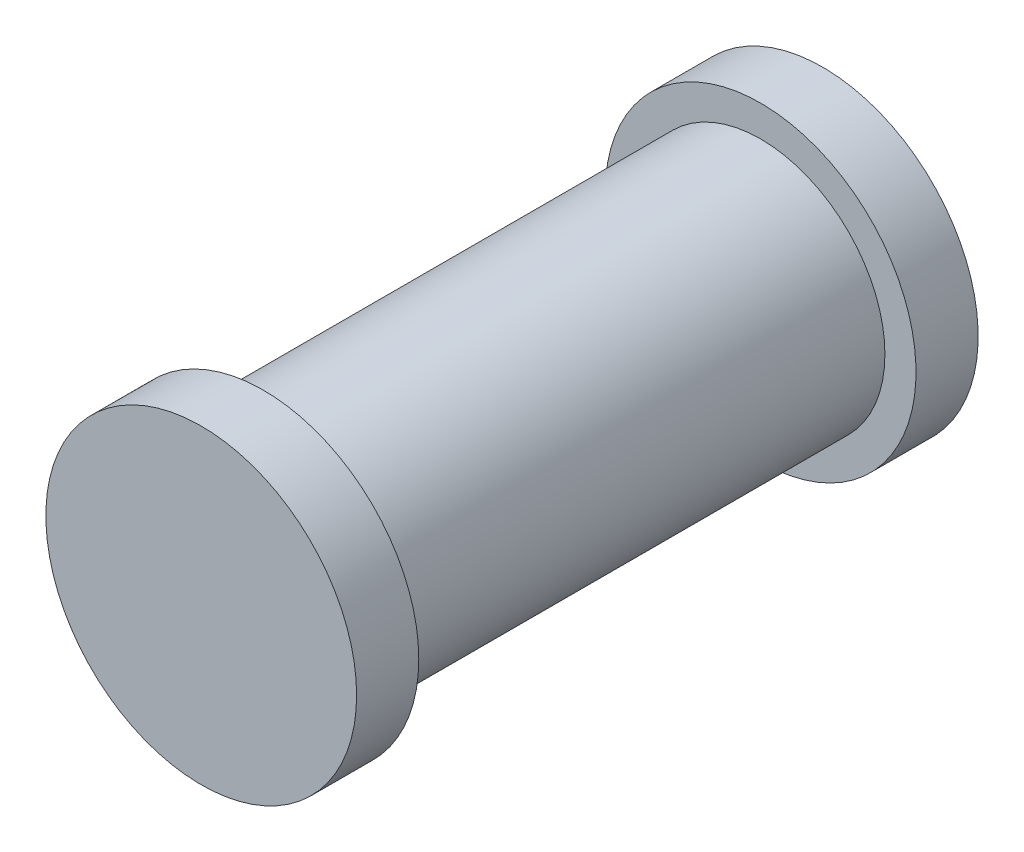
from build123d import *

# Parameters (mm, degrees)
SKETCH1_R      = 6.35
EXTRUDE1_DEPTH = 25.4
SKETCH2_R      = 7.9375
EXTRUDE2_DEPTH = 3.175
EXTRUDE3_START = 3.175
SKETCH3_R      = 7.9375
EXTRUDE3_DEPTH = 3.175


with BuildPart() as part:
    # Sketch1 → Extrude1 (new body)
    with BuildSketch(Plane.XY):
        Circle(SKETCH1_R)
    extrude(amount=-EXTRUDE1_DEPTH)

    # Sketch2 → Extrude2 (add)
    with BuildSketch(Plane.XY):
        Circle(SKETCH2_R)
    extrude(amount=EXTRUDE2_DEPTH)

    # Sketch3 → Extrude3 (add)
    with BuildSketch(Plane(origin=(0, 0, -25.4), x_dir=(-1, 0, 0), z_dir=(0, 0, -1)).offset(EXTRUDE3_START)):
        with Locations(Location((0, 0, 0), (0, 0, 180))):
            Circle(SKETCH3_R)
    extrude(amount=-EXTRUDE3_DEPTH)


solid = part.part
